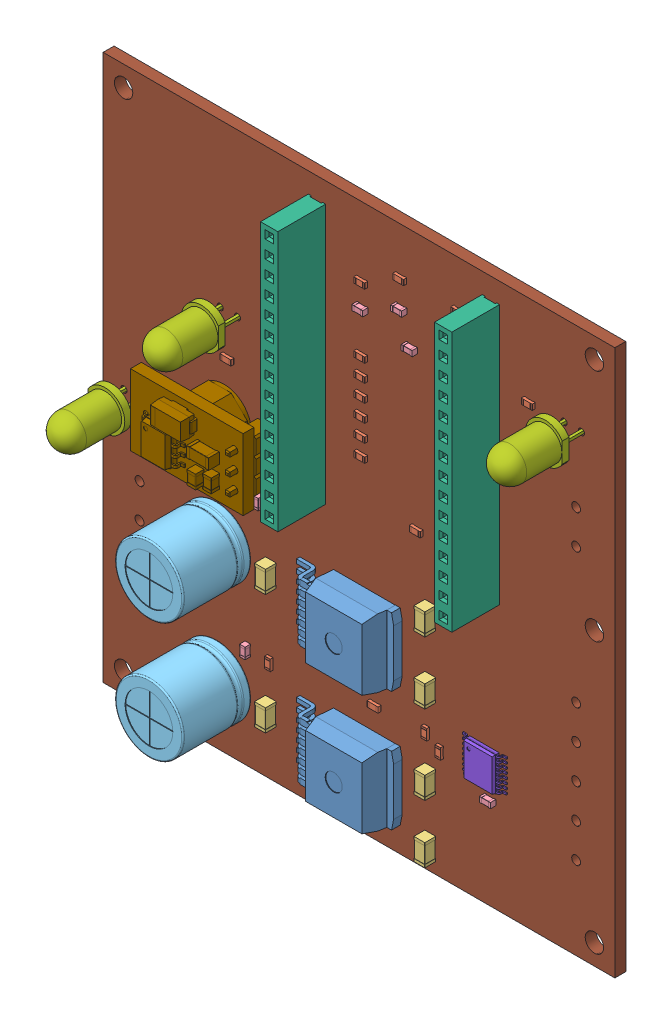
SolidWorks assembly Doggy Door Controller.sldasm, configuration Default (file format 14000). Lengths in mm.
Overall size (75 80 15.91).
99 component instances, 11 part files, 0 mates.
Components (placement in the parent):
- TO-263-7_TabPin8-1: TO-263-7_TabPin8.SLDASM [Default] at (0.763 -13.693 1.65) size (15 10 4.42)
  - CQ assembly-1: CQ assembly.SLDPRT [Default] at origin size (15 10 4.42)
- R_0603_1608Metric-1: R_0603_1608Metric.SLDASM [Default] at (0.529 29.972 1.65) size (1.6 0.8 0.45)
  - R_0603_1608Metric-1: R_0603_1608Metric.SLDPRT [Default] at origin size (1.6 0.8 0.45)
- C_1206_3216Metric-1: C_1206_3216Metric.SLDASM [Default] at (10.506 -16.5485 1.65) x (0 1 0) z (0 0 1) size (3.2 1.6 1.6)
  - C_1206_3216Metric-1: C_1206_3216Metric.SLDPRT [Default] at origin size (3.2 1.6 1.6)
- R_0603_1608Metric-2: R_0603_1608Metric.SLDASM [Default] at (6.2385 33.274 1.65) size (1.6 0.8 0.45)
  - R_0603_1608Metric-1: R_0603_1608Metric.SLDPRT [Default] at origin size (1.6 0.8 0.45)
- C_0603_1608Metric-1: C_0603_1608Metric.SLDASM [Default] at (14.687 20.574 1.65) x (-1 0 0) z (0 0 1) size (1.6 0.8 0.8)
  - C_0603_1608Metric-1: C_0603_1608Metric.SLDPRT [Default] at origin size (1.6 0.8 0.8)
- R_0603_1608Metric-3: R_0603_1608Metric.SLDASM [Default] at (14.753 25.654 1.65) size (1.6 0.8 0.45)
  - R_0603_1608Metric-1: R_0603_1608Metric.SLDPRT [Default] at origin size (1.6 0.8 0.45)
- R_0603_1608Metric-4: R_0603_1608Metric.SLDASM [Default] at (2.4815 -22.86 1.65) x (-1 0 0) z (0 0 1) size (1.6 0.8 0.45)
  - R_0603_1608Metric-1: R_0603_1608Metric.SLDPRT [Default] at origin size (1.6 0.8 0.45)
- CP_Radial_D10.0mm_P5.00mm-1: CP_Radial_D10.0mm_P5.00mm.SLDASM [Default] at (-20.736 -16.0607 1.65) x (0 1 0) z (0 0 1) size (12.36 12.78 12)
  - CP_Radial_D100mm_P500mm-1: CP_Radial_D100mm_P500mm.SLDPRT [Default] at origin size (12.36 12.78 12)
- C_1206_3216Metric-2: C_1206_3216Metric.SLDASM [Default] at (10.496 -36.7005 1.65) x (0 1 0) z (0 0 1) size (3.2 1.6 1.6)
  - C_1206_3216Metric-1: C_1206_3216Metric.SLDPRT [Default] at origin size (3.2 1.6 1.6)
- R_0603_1608Metric-5: R_0603_1608Metric.SLDASM [Default] at (24.4252 22.098 1.65) x (0 -1 0) z (0 0 1) size (1.6 0.8 0.45)
  - R_0603_1608Metric-1: R_0603_1608Metric.SLDPRT [Default] at origin size (1.6 0.8 0.45)
- R_0603_1608Metric-6: R_0603_1608Metric.SLDASM [Default] at (-11.034 -5.2155 1.65) x (0 1 0) z (0 0 1) size (1.6 0.8 0.45)
  - R_0603_1608Metric-1: R_0603_1608Metric.SLDPRT [Default] at origin size (1.6 0.8 0.45)
- C_0603_1608Metric-2: C_0603_1608Metric.SLDASM [Default] at (-14.336 -5.2185 1.65) x (0 1 0) z (0 0 1) size (1.6 0.8 0.8)
  - C_0603_1608Metric-1: C_0603_1608Metric.SLDPRT [Default] at origin size (1.6 0.8 0.8)
- PinSocket_1x15_P2.54mm_Vertical-1: PinSocket_1x15_P2.54mm_Vertical.SLDASM [Default] at (19.388 35.814 1.65) size (2.54 38.1 10.1)
  - PinSocket_1x15_P254mm_Vertical-1: PinSocket_1x15_P254mm_Vertical.SLDPRT [Default] at origin size (2.54 38.1 10.1)
- R_0603_1608Metric-7: R_0603_1608Metric.SLDASM [Default] at (0.529 7.874 1.65) x (-1 0 0) z (0 0 1) size (1.6 0.8 0.45)
  - R_0603_1608Metric-1: R_0603_1608Metric.SLDPRT [Default] at origin size (1.6 0.8 0.45)
- LED_D5.0mm-1: LED_D5.0mm.SLDASM [Default] at (32.601 26.868 1.65) x (-1 0 0) z (0 0 1) size (5.4 5.8 14.1)
  - LED_D5.0mm-1: LED_D5.0mm.SLDPRT [Default] at origin size (5.4 5.8 14.1)
- R_0603_1608Metric-8: R_0603_1608Metric.SLDASM [Default] at (0.529 18.034 1.65) x (-1 0 0) z (0 0 1) size (1.6 0.8 0.45)
  - R_0603_1608Metric-1: R_0603_1608Metric.SLDPRT [Default] at origin size (1.6 0.8 0.45)
- R_0603_1608Metric-9: R_0603_1608Metric.SLDASM [Default] at (0.529 12.954 1.65) x (-1 0 0) z (0 0 1) size (1.6 0.8 0.45)
  - R_0603_1608Metric-1: R_0603_1608Metric.SLDPRT [Default] at origin size (1.6 0.8 0.45)
- C_0603_1608Metric-3: C_0603_1608Metric.SLDASM [Default] at (-16.2475 -25.0655 1.65) x (0 -1 0) z (0 0 1) size (1.6 0.8 0.8)
  - C_0603_1608Metric-1: C_0603_1608Metric.SLDPRT [Default] at origin size (1.6 0.8 0.8)
- C_0603_1608Metric-4: C_0603_1608Metric.SLDASM [Default] at (14.687 23.114 1.65) x (-1 0 0) z (0 0 1) size (1.6 0.8 0.8)
  - C_0603_1608Metric-1: C_0603_1608Metric.SLDPRT [Default] at origin size (1.6 0.8 0.8)
- TO-263-7_TabPin8-2: TO-263-7_TabPin8.SLDASM [Default] at (0.763 -31.2733 1.65) size (15 10 4.42)
  - CQ assembly-1: CQ assembly.SLDPRT [Default] at origin size (15 10 4.42)
- R_0603_1608Metric-10: R_0603_1608Metric.SLDASM [Default] at (8.6535 2.472 1.65) size (1.6 0.8 0.45)
  - R_0603_1608Metric-1: R_0603_1608Metric.SLDPRT [Default] at origin size (1.6 0.8 0.45)
- C_0603_1608Metric-5: C_0603_1608Metric.SLDASM [Default] at (0.592 26.67 1.65) size (1.6 0.8 0.8)
  - C_0603_1608Metric-1: C_0603_1608Metric.SLDPRT [Default] at origin size (1.6 0.8 0.8)
- LED_D5.0mm-2: LED_D5.0mm.SLDASM [Default] at (-34.452 -1.27 1.65) size (5.4 5.8 14.1)
  - LED_D5.0mm-1: LED_D5.0mm.SLDPRT [Default] at origin size (5.4 5.8 14.1)
- R_0603_1608Metric-11: R_0603_1608Metric.SLDASM [Default] at (25.0875 26.868 1.65) x (-1 0 0) z (0 0 1) size (1.6 0.8 0.45)
  - R_0603_1608Metric-1: R_0603_1608Metric.SLDPRT [Default] at origin size (1.6 0.8 0.45)
- C_1206_3216Metric-3: C_1206_3216Metric.SLDASM [Default] at (10.506 -28.1555 1.65) x (0 1 0) z (0 0 1) size (3.2 1.6 1.6)
  - C_1206_3216Metric-1: C_1206_3216Metric.SLDPRT [Default] at origin size (3.2 1.6 1.6)
- R_0603_1608Metric-12: R_0603_1608Metric.SLDASM [Default] at (14.753 33.274 1.65) size (1.6 0.8 0.45)
  - R_0603_1608Metric-1: R_0603_1608Metric.SLDPRT [Default] at origin size (1.6 0.8 0.45)
- R_0603_1608Metric-13: R_0603_1608Metric.SLDASM [Default] at (0.529 20.574 1.65) x (-1 0 0) z (0 0 1) size (1.6 0.8 0.45)
  - R_0603_1608Metric-1: R_0603_1608Metric.SLDPRT [Default] at origin size (1.6 0.8 0.45)
- R_0603_1608Metric-14: R_0603_1608Metric.SLDASM [Default] at (12.03 -23.876 1.65) x (0 -1 0) z (0 0 1) size (1.6 0.8 0.45)
  - R_0603_1608Metric-1: R_0603_1608Metric.SLDPRT [Default] at origin size (1.6 0.8 0.45)
- C_1206_3216Metric-4: C_1206_3216Metric.SLDASM [Default] at (10.506 -7.4045 1.65) x (0 1 0) z (0 0 1) size (3.2 1.6 1.6)
  - C_1206_3216Metric-1: C_1206_3216Metric.SLDPRT [Default] at origin size (3.2 1.6 1.6)
- CP_Radial_D10.0mm_P5.00mm-2: CP_Radial_D10.0mm_P5.00mm.SLDASM [Default] at (-20.736 -33.641 1.65) x (0 1 0) z (0 0 1) size (12.36 12.78 12)
  - CP_Radial_D100mm_P500mm-1: CP_Radial_D100mm_P500mm.SLDPRT [Default] at origin size (12.36 12.78 12)
- R_0603_1608Metric-15: R_0603_1608Metric.SLDASM [Default] at (-31.0465 -5.528 1.65) x (-1 0 0) z (0 0 1) size (1.6 0.8 0.45)
  - R_0603_1608Metric-1: R_0603_1608Metric.SLDPRT [Default] at origin size (1.6 0.8 0.45)
- R_0603_1608Metric-16: R_0603_1608Metric.SLDASM [Default] at (24.476 17.8816 1.65) x (0 -1 0) z (0 0 1) size (1.6 0.8 0.45)
  - R_0603_1608Metric-1: R_0603_1608Metric.SLDPRT [Default] at origin size (1.6 0.8 0.45)
- C_0603_1608Metric-6: C_0603_1608Metric.SLDASM [Default] at (6.2885 29.464 1.65) size (1.6 0.8 0.8)
  - C_0603_1608Metric-1: C_0603_1608Metric.SLDPRT [Default] at origin size (1.6 0.8 0.8)
- R_0603_1608Metric-17: R_0603_1608Metric.SLDASM [Default] at (-12.9325 -25.1155 1.65) x (0 -1 0) z (0 0 1) size (1.6 0.8 0.45)
  - R_0603_1608Metric-1: R_0603_1608Metric.SLDPRT [Default] at origin size (1.6 0.8 0.45)
- TSSOP-16_4.4x5mm_P0.65mm-1: TSSOP-16_4.4x5mm_P0.65mm.SLDASM [Default] at (18.5805 -22.157 1.65) size (6.4 5 1.1)
  - TSSOP_16_44x5mm_P065mm-1: TSSOP_16_44x5mm_P065mm.SLDPRT [Default] at origin size (6.4 5 1.1)
- R_0603_1608Metric-18: R_0603_1608Metric.SLDASM [Default] at (0.529 10.414 1.65) x (-1 0 0) z (0 0 1) size (1.6 0.8 0.45)
  - R_0603_1608Metric-1: R_0603_1608Metric.SLDPRT [Default] at origin size (1.6 0.8 0.45)
- R_0603_1608Metric-19: R_0603_1608Metric.SLDASM [Default] at (-19.08 10.414 1.65) size (1.6 0.8 0.45)
  - R_0603_1608Metric-1: R_0603_1608Metric.SLDPRT [Default] at origin size (1.6 0.8 0.45)
- R_0603_1608Metric-20: R_0603_1608Metric.SLDASM [Default] at (0.529 15.494 1.65) x (-1 0 0) z (0 0 1) size (1.6 0.8 0.45)
  - R_0603_1608Metric-1: R_0603_1608Metric.SLDPRT [Default] at origin size (1.6 0.8 0.45)
- R_0603_1608Metric-21: R_0603_1608Metric.SLDASM [Default] at (14.753 15.494 1.65) size (1.6 0.8 0.45)
  - R_0603_1608Metric-1: R_0603_1608Metric.SLDPRT [Default] at origin size (1.6 0.8 0.45)
- C_1206_3216Metric-5: C_1206_3216Metric.SLDASM [Default] at (-12.862 -31.2733 1.65) x (0 1 0) z (0 0 1) size (3.2 1.6 1.6)
  - C_1206_3216Metric-1: C_1206_3216Metric.SLDPRT [Default] at origin size (3.2 1.6 1.6)
- C_0603_1608Metric-7: C_0603_1608Metric.SLDASM [Default] at (7.8285 25.222 1.65) x (-1 0 0) z (0 0 1) size (1.6 0.8 0.8)
  - C_0603_1608Metric-1: C_0603_1608Metric.SLDPRT [Default] at origin size (1.6 0.8 0.8)
- PinSocket_1x15_P2.54mm_Vertical-2: PinSocket_1x15_P2.54mm_Vertical.SLDASM [Default] at (-6.112 35.814 1.65) size (2.54 38.1 10.1)
  - PinSocket_1x15_P254mm_Vertical-1: PinSocket_1x15_P254mm_Vertical.SLDPRT [Default] at origin size (2.54 38.1 10.1)
- C_0603_1608Metric-8: C_0603_1608Metric.SLDASM [Default] at (19.3035 -26.408 1.65) size (1.6 0.8 0.8)
  - C_0603_1608Metric-1: C_0603_1608Metric.SLDPRT [Default] at origin size (1.6 0.8 0.8)
- LED_D5.0mm-3: LED_D5.0mm.SLDASM [Default] at (-17.805 16.256 1.65) x (-1 0 0) z (0 0 1) size (5.4 5.8 14.1)
  - LED_D5.0mm-1: LED_D5.0mm.SLDPRT [Default] at origin size (5.4 5.8 14.1)
- R_0603_1608Metric-22: R_0603_1608Metric.SLDASM [Default] at (9.998 -22.4555 1.65) x (0 -1 0) z (0 0 1) size (1.6 0.8 0.45)
  - R_0603_1608Metric-1: R_0603_1608Metric.SLDPRT [Default] at origin size (1.6 0.8 0.45)
- C_1206_3216Metric-6: C_1206_3216Metric.SLDASM [Default] at (-12.862 -13.693 1.65) x (0 1 0) z (0 0 1) size (3.2 1.6 1.6)
  - C_1206_3216Metric-1: C_1206_3216Metric.SLDPRT [Default] at origin size (3.2 1.6 1.6)
- R_0603_1608Metric-23: R_0603_1608Metric.SLDASM [Default] at (13.991 0.254 1.65) size (1.6 0.8 0.45)
  - R_0603_1608Metric-1: R_0603_1608Metric.SLDPRT [Default] at origin size (1.6 0.8 0.45)
- Converter_DCDC_Murata_OKI-78SR_Horizontal-1: Converter_DCDC_Murata_OKI-78SR_Horizontal.SLDASM [Default] at (-12.1 5.334 1.65) x (0 -1 0) z (0 0 1) size (10.41 16.51 12.92)
  - Converter_DCDC_muRata_OKI-78SR_horizontal-1: Converter_DCDC_muRata_OKI-78SR_horizontal.SLDPRT [Default] at origin size (10.41 16.51 12.92)
- R_1206_3216Metric-1: R_1206_3216Metric.SLDASM [Default] at (18.716 -17.928 -0.05) x (1 0 0) z (0 0 -1) size (3.2 1.6 0.55)
  - R_1206_3216Metric-1: R_1206_3216Metric.SLDPRT [Default] at origin size (3.2 1.6 0.55)
- Doggy Door Controller_PCB-1: Doggy Door Controller_PCB.SLDPRT [Default] at origin size (75 80 1.6)
